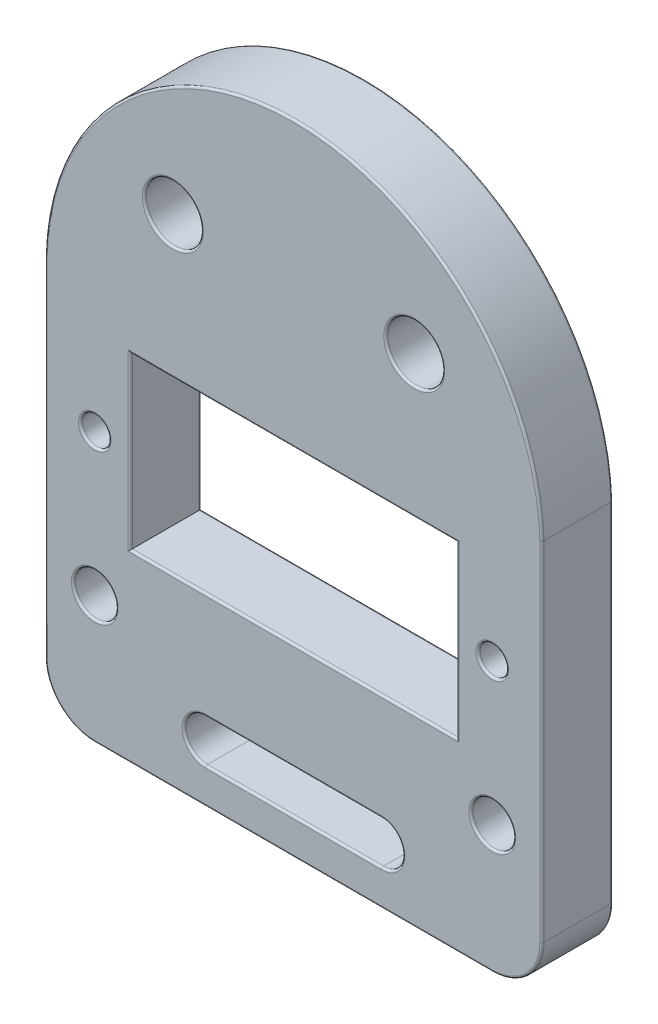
from build123d import *

# Parameters (mm, degrees)
SKETCH1_R           = 1
SKETCH1_R_2         = 1.5
SKETCH1_R_3         = 2
SKETCH1_W           = 23
SKETCH1_H           = 12
BOSS_EXTRUDE1_DEPTH = 5
FILLET1_R           = 3.5
FILLET2_R           = 0.15


with BuildPart() as part:
    # Sketch1 → Boss-Extrude1 (new body)
    with BuildSketch(Plane.XY):
        with BuildLine():
            Line((-17.5, 9), (-17.5, -19))
            Line((-17.5, -19), (17.5, -19))
            Line((17.5, -19), (17.5, 9))
            ThreePointArc((17.5, 9), (0, 26), (-17.5, 9))
        make_face()
        with Locations((-14, 0)):
            Circle(SKETCH1_R, mode=Mode.SUBTRACT)
        with Locations((-14, -10)):
            Circle(SKETCH1_R_2, mode=Mode.SUBTRACT)
        with Locations((-8.5, 16)):
            Circle(SKETCH1_R_3, mode=Mode.SUBTRACT)
        with Locations(Location((14, -10, 0), (0, 0, 180))):
            Circle(SKETCH1_R_2, mode=Mode.SUBTRACT)
        with Locations(Location((14, 0, 0), (0, 0, 180))):
            Circle(SKETCH1_R, mode=Mode.SUBTRACT)
        with Locations(Location((8.5, 16, 0), (0, 0, 180))):
            Circle(SKETCH1_R_3, mode=Mode.SUBTRACT)
        Rectangle(SKETCH1_W, SKETCH1_H, mode=Mode.SUBTRACT)
        with BuildLine():
            Line((-6.2, -13.5), (6.2, -13.5))
            ThreePointArc((6.2, -13.5), (7.7, -15), (6.2, -16.5))
            Line((6.2, -16.5), (-6.2, -16.5))
            ThreePointArc((-6.2, -16.5), (-7.7, -15), (-6.2, -13.5))
        make_face(mode=Mode.SUBTRACT)
    extrude(amount=BOSS_EXTRUDE1_DEPTH)

    # Fillet1
    fillet1_edges = [part.edges().sort_by_distance(p)[0] for p in [
        (17.5, -19, 2.5),
        (-17.5, -19, 2.5),
    ]]
    fillet(fillet1_edges, radius=FILLET1_R)

    # Fillet2
    fillet2_edges = [part.edges().sort_by_distance(p)[0] for p in [
        (-11.5, 0, 0),
        (0, -6, 0),
        (11.5, 0, 0),
        (0, 6, 0),
        (-11.5, 0, 5),
        (0, -6, 5),
        (11.5, 0, 5),
        (0, 6, 5),
        (-15, 0, 0),
        (-15, 0, 5),
        (-15.5, -10, 0),
        (-15.5, -10, 5),
        (-7.7, -15, 0),
        (0, -16.5, 0),
        (7.7, -15, 0),
        (0, -13.5, 0),
        (-7.7, -15, 5),
        (0, -16.5, 5),
        (7.7, -15, 5),
        (0, -13.5, 5),
        (0, 26, 5),
        (-10.5, 16, 0),
        (-10.5, 16, 5),
        (15.5, -10, 0),
        (15.5, -10, 5),
        (-17.5, -3.25, 0),
        (15, 0, 0),
        (15, 0, 5),
        (0, 26, 0),
        (10.5, 16, 0),
        (10.5, 16, 5),
        (17.5, -3.25, 0),
        (17.5, -3.25, 5),
        (0, -19, 0),
        (-16.474873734, -17.974873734, 0),
        (16.474873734, -17.974873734, 0),
        (0, -19, 5),
        (-17.5, -3.25, 5),
        (-16.474873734, -17.974873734, 5),
        (16.474873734, -17.974873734, 5),
    ]]
    fillet(fillet2_edges, radius=FILLET2_R)


solid = part.part
